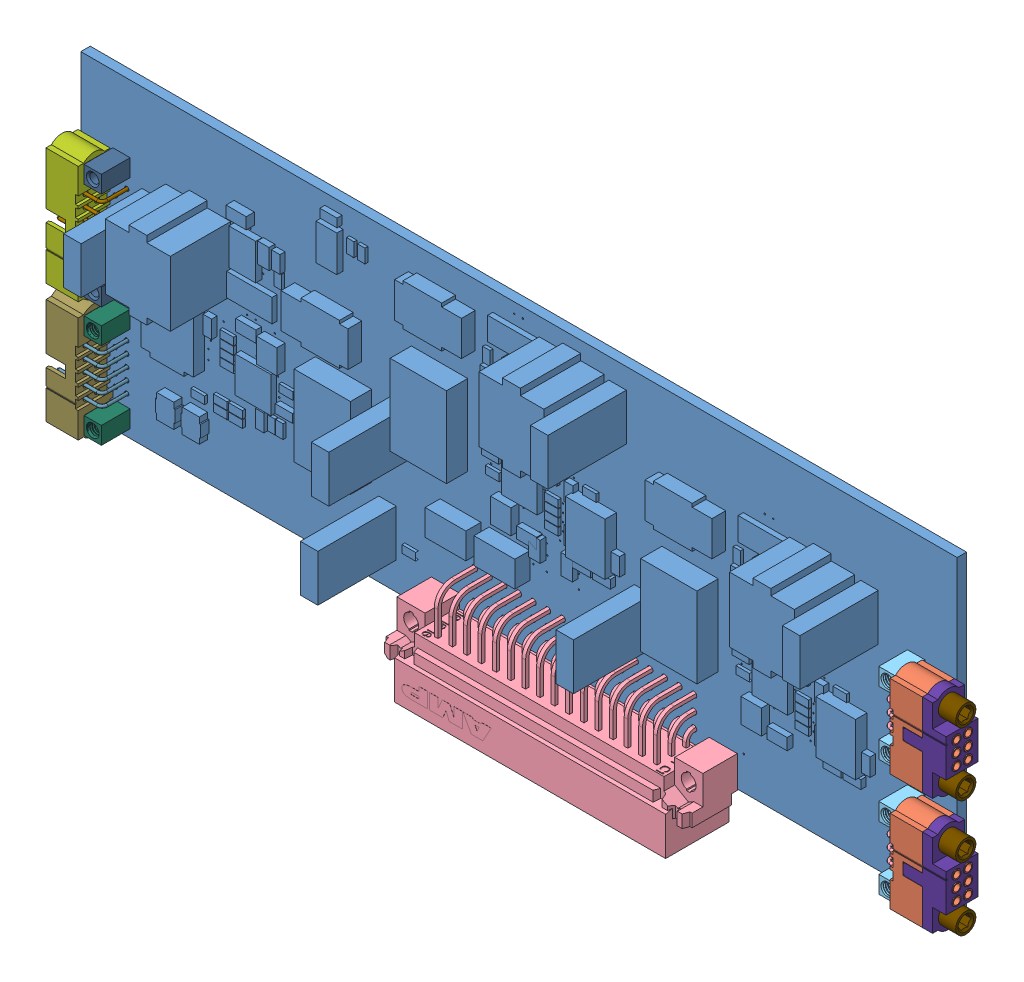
SolidWorks assembly SwitchBoard.SLDASM, configuration Default (file format 9000). Lengths in mm.
Overall size (157.18 61.26 17.98).
110 component instances, 22 part files, 20 mates.
Components (placement in the parent):
- 100221094ra_solid_4-1: 100221094ra_solid_4.SLDPRT [Default] at origin size (152.4 53.98 16.37)
- m80-5400642_asm-1: m80-5400642_asm.SLDASM [Default] at (148.998 28.797 4.9158) x (0 -1 0) z (0 0 1) size (16 9.1 9.13)
  - M80-2702098_SEPARATE_ROWS_1-1: M80-2702098_SEPARATE_ROWS_1.sldprt [Default] at origin size (16 5.6 6.05)
  - M80-530XX22_SHORT_PIN_1-1: M80-530XX22_SHORT_PIN_1.sldprt [Default] at (-2 -2.6 -1) x (0 -1 0) z (-1 0 0) size (5.95 5.68 0.8)
  - M80-530XX22_SHORT_PIN_1-2: M80-530XX22_SHORT_PIN_1.sldprt [Default] at (0 -2.6 -1) x (0 -1 0) z (-1 0 0) size (5.95 5.68 0.8)
  - M80-530XX22_SHORT_PIN_1-3: M80-530XX22_SHORT_PIN_1.sldprt [Default] at (2 -2.6 -1) x (0 -1 0) z (-1 0 0) size (5.95 5.68 0.8)
  - M80-530XX22_LONG_PIN_1-1: M80-530XX22_LONG_PIN_1.sldprt [Default] at (-2 -4.6 1) x (0 -1 0) z (-1 0 0) size (7.95 7.68 0.8)
  - M80-530XX22_LONG_PIN_1-2: M80-530XX22_LONG_PIN_1.sldprt [Default] at (0 -4.6 1) x (0 -1 0) z (-1 0 0) size (7.95 7.68 0.8)
  - M80-530XX22_LONG_PIN_1-3: M80-530XX22_LONG_PIN_1.sldprt [Default] at (2 -4.6 1) x (0 -1 0) z (-1 0 0) size (7.95 7.68 0.8)
  - M80-2250000-1: M80-2250000.sldprt [Default] at (5.5 -2.2 0) x (-1 0 0) z (0 1 0) size (3.1 5 7.5)
  - M80-2250000-2: M80-2250000.sldprt [Default] at (-5.5 -2.2 0) x (-1 0 0) z (0 1 0) size (3.1 5 7.5)
  - M80-226-1: M80-226.sldprt [Default] at (5.5 -3.7 -4.85) x (0 0 1) z (0 1 0) size (5 4 4)
  - M80-226-2: M80-226.sldprt [Default] at (-5.5 -3.7 -4.85) x (0 0 1) z (0 1 0) size (5 4 4)
- m80-5400642_asm-2: m80-5400642_asm.SLDASM [Default] at (148.998 8.477 4.9158) x (0 -1 0) z (0 0 1) size (16 9.1 9.13)
  - M80-2702098_SEPARATE_ROWS_1-1: M80-2702098_SEPARATE_ROWS_1.sldprt [Default] at origin size (16 5.6 6.05)
  - M80-530XX22_SHORT_PIN_1-1: M80-530XX22_SHORT_PIN_1.sldprt [Default] at (-2 -2.6 -1) x (0 -1 0) z (-1 0 0) size (5.95 5.68 0.8)
  - M80-530XX22_SHORT_PIN_1-2: M80-530XX22_SHORT_PIN_1.sldprt [Default] at (0 -2.6 -1) x (0 -1 0) z (-1 0 0) size (5.95 5.68 0.8)
  - M80-530XX22_SHORT_PIN_1-3: M80-530XX22_SHORT_PIN_1.sldprt [Default] at (2 -2.6 -1) x (0 -1 0) z (-1 0 0) size (5.95 5.68 0.8)
  - M80-530XX22_LONG_PIN_1-1: M80-530XX22_LONG_PIN_1.sldprt [Default] at (-2 -4.6 1) x (0 -1 0) z (-1 0 0) size (7.95 7.68 0.8)
  - M80-530XX22_LONG_PIN_1-2: M80-530XX22_LONG_PIN_1.sldprt [Default] at (0 -4.6 1) x (0 -1 0) z (-1 0 0) size (7.95 7.68 0.8)
  - M80-530XX22_LONG_PIN_1-3: M80-530XX22_LONG_PIN_1.sldprt [Default] at (2 -4.6 1) x (0 -1 0) z (-1 0 0) size (7.95 7.68 0.8)
  - M80-2250000-1: M80-2250000.sldprt [Default] at (5.5 -2.2 0) x (-1 0 0) z (0 1 0) size (3.1 5 7.5)
  - M80-2250000-2: M80-2250000.sldprt [Default] at (-5.5 -2.2 0) x (-1 0 0) z (0 1 0) size (3.1 5 7.5)
  - M80-226-1: M80-226.sldprt [Default] at (5.5 -3.7 -4.85) x (0 0 1) z (0 1 0) size (5 4 4)
  - M80-226-2: M80-226.sldprt [Default] at (-5.5 -3.7 -4.85) x (0 0 1) z (0 1 0) size (5 4 4)
- m80-54112xx_asm-1: m80-54112xx_asm.SLDASM [Default] at (3.402 32.305 4.9158) x (0 1 0) z (0 0 1) size (22 9.08 10.41)
  - M80-2700698_SEPARATE_ROWS-1: M80-2700698_SEPARATE_ROWS.sldprt [Default] at origin size (22 5.6 6.05)
  - M80-531XX22_SHORT_PIN-1: M80-531XX22_SHORT_PIN.sldprt [Default] at (-5 -2.6 -1) x (0 -1 0) z (-1 0 0) size (5.95 7.03 0.8)
  - M80-531XX22_SHORT_PIN-2: M80-531XX22_SHORT_PIN.sldprt [Default] at (-3 -2.6 -1) x (0 -1 0) z (-1 0 0) size (5.95 7.03 0.8)
  - M80-531XX22_SHORT_PIN-3: M80-531XX22_SHORT_PIN.sldprt [Default] at (-1 -2.6 -1) x (0 -1 0) z (-1 0 0) size (5.95 7.03 0.8)
  - M80-531XX22_SHORT_PIN-4: M80-531XX22_SHORT_PIN.sldprt [Default] at (1 -2.6 -1) x (0 -1 0) z (-1 0 0) size (5.95 7.03 0.8)
  - M80-531XX22_SHORT_PIN-5: M80-531XX22_SHORT_PIN.sldprt [Default] at (3 -2.6 -1) x (0 -1 0) z (-1 0 0) size (5.95 7.03 0.8)
  - M80-531XX22_SHORT_PIN-6: M80-531XX22_SHORT_PIN.sldprt [Default] at (5 -2.6 -1) x (0 -1 0) z (-1 0 0) size (5.95 7.03 0.8)
  - M80-531XX22_LONG_PIN-1: M80-531XX22_LONG_PIN.sldprt [Default] at (-5 -4.6 1) x (0 -1 0) z (-1 0 0) size (7.95 9.03 0.8)
  - M80-531XX22_LONG_PIN-2: M80-531XX22_LONG_PIN.sldprt [Default] at (-3 -4.6 1) x (0 -1 0) z (-1 0 0) size (7.95 9.03 0.8)
  - M80-531XX22_LONG_PIN-3: M80-531XX22_LONG_PIN.sldprt [Default] at (-1 -4.6 1) x (0 -1 0) z (-1 0 0) size (7.95 9.03 0.8)
  - M80-531XX22_LONG_PIN-4: M80-531XX22_LONG_PIN.sldprt [Default] at (1 -4.6 1) x (0 -1 0) z (-1 0 0) size (7.95 9.03 0.8)
  - M80-531XX22_LONG_PIN-5: M80-531XX22_LONG_PIN.sldprt [Default] at (3 -4.6 1) x (0 -1 0) z (-1 0 0) size (7.95 9.03 0.8)
  - M80-531XX22_LONG_PIN-6: M80-531XX22_LONG_PIN.sldprt [Default] at (5 -4.6 1) x (0 -1 0) z (-1 0 0) size (7.95 9.03 0.8)
  - M80-2250000_1-1: M80-2250000_1.sldprt [Default] at (8.5 -2.2 0) x (-1 0 0) z (0 1 0) size (3.1 5 7.5)
  - M80-2250000_1-2: M80-2250000_1.sldprt [Default] at (-8.5 -2.2 0) x (-1 0 0) z (0 1 0) size (3.1 5 7.5)
  - M80-227-1: M80-227.sldprt [Default] at (8.5 -3.7 -6.05) x (0 0 1) z (0 1 0) size (6.21 3.96 3.96)
  - M80-227-2: M80-227.sldprt [Default] at (-8.5 -3.7 -6.05) x (0 0 1) z (0 1 0) size (6.21 3.96 3.96)
- m80-5401042_asm-1: m80-5401042_asm.SLDASM [Default] at (3.402 10.477 4.9158) x (0 1 0) z (0 0 1) size (20 9.1 9.13)
  - M80-2702098_SEPARATE_ROWS_2-1: M80-2702098_SEPARATE_ROWS_2.sldprt [Default] at origin size (20 5.6 6.05)
  - M80-530XX22_SHORT_PIN_2-1: M80-530XX22_SHORT_PIN_2.sldprt [Default] at (-4 -2.6 -1) x (0 -1 0) z (-1 0 0) size (5.95 5.68 0.8)
  - M80-530XX22_SHORT_PIN_2-2: M80-530XX22_SHORT_PIN_2.sldprt [Default] at (-2 -2.6 -1) x (0 -1 0) z (-1 0 0) size (5.95 5.68 0.8)
  - M80-530XX22_SHORT_PIN_2-3: M80-530XX22_SHORT_PIN_2.sldprt [Default] at (0 -2.6 -1) x (0 -1 0) z (-1 0 0) size (5.95 5.68 0.8)
  - M80-530XX22_SHORT_PIN_2-4: M80-530XX22_SHORT_PIN_2.sldprt [Default] at (2 -2.6 -1) x (0 -1 0) z (-1 0 0) size (5.95 5.68 0.8)
  - M80-530XX22_SHORT_PIN_2-5: M80-530XX22_SHORT_PIN_2.sldprt [Default] at (4 -2.6 -1) x (0 -1 0) z (-1 0 0) size (5.95 5.68 0.8)
  - M80-530XX22_LONG_PIN_2-1: M80-530XX22_LONG_PIN_2.sldprt [Default] at (-4 -4.6 1) x (0 -1 0) z (-1 0 0) size (7.95 7.68 0.8)
  - M80-530XX22_LONG_PIN_2-2: M80-530XX22_LONG_PIN_2.sldprt [Default] at (-2 -4.6 1) x (0 -1 0) z (-1 0 0) size (7.95 7.68 0.8)
  - M80-530XX22_LONG_PIN_2-3: M80-530XX22_LONG_PIN_2.sldprt [Default] at (0 -4.6 1) x (0 -1 0) z (-1 0 0) size (7.95 7.68 0.8)
  - M80-530XX22_LONG_PIN_2-4: M80-530XX22_LONG_PIN_2.sldprt [Default] at (2 -4.6 1) x (0 -1 0) z (-1 0 0) size (7.95 7.68 0.8)
  - M80-530XX22_LONG_PIN_2-5: M80-530XX22_LONG_PIN_2.sldprt [Default] at (4 -4.6 1) x (0 -1 0) z (-1 0 0) size (7.95 7.68 0.8)
  - M80-2250000_2-1: M80-2250000_2.sldprt [Default] at (7.5 -2.2 0) x (-1 0 0) z (0 1 0) size (3.1 5 7.5)
  - M80-2250000_2-2: M80-2250000_2.sldprt [Default] at (-7.5 -2.2 0) x (-1 0 0) z (0 1 0) size (3.1 5 7.5)
  - M80-226_1-1: M80-226_1.sldprt [Default] at (7.5 -3.7 -4.85) x (0 0 1) z (0 1 0) size (5 4 4)
  - M80-226_1-2: M80-226_1.sldprt [Default] at (-7.5 -3.7 -4.85) x (0 0 1) z (0 1 0) size (5 4 4)
- m80-4810642_asm-1: m80-4810642_asm.SLDASM [Default] at (148.978 8.477 4.9158) x (0 1 0) z (0 0 1) size (16 8.5 5.55)
  - M80-2662098_ASM_1-1: M80-2662098_ASM_1.sldasm [Default] at origin size (16 8.5 5.55)
    - M80-2625098_1-1: M80-2625098_1.sldprt [Default] at origin size (16 7.55 5.55)
    - M80-218_1-1: M80-218_1.sldprt [Default] at (5.5 -5.2 0) x (0.866025 0 -0.5) z (-0.5 0 -0.866025) size (3.5 8.5 3.5)
    - M80-218_1-2: M80-218_1.sldprt [Default] at (-5.5 -5.2 0) x (0.866025 0 0.5) z (0.5 0 -0.866025) size (3.5 8.5 3.5)
    - M80-215_1-1: M80-215_1.sldprt [Default] at (5.5 -3.12 0) size (3 0.3 2.57)
    - M80-215_1-2: M80-215_1.sldprt [Default] at (-5.5 -3.12 0) size (3 0.3 2.57)
  - M80-013_ASM_1-1: M80-013_ASM_1.sldasm [Default] at (-2 -7.65 -1) x (-1 0 0) z (0 0 1) size (1.48 7.45 1.48)
    - M80-012_1-1: M80-012_1.sldprt [Default] at origin size (1.48 7.45 1.48)
    - Y3198_1-1: Y3198_1.sldprt [Default] at (0 -6.44 0) x (-1 0 0) z (0 0 1) size (0.86 1.68 0.86)
  - M80-013_ASM_1-2: M80-013_ASM_1.sldasm [Default] at (0 -7.65 -1) x (-1 0 0) z (0 0 1) size (1.48 7.45 1.48)
    - M80-012_1-1: M80-012_1.sldprt [Default] at origin size (1.48 7.45 1.48)
    - Y3198_1-1: Y3198_1.sldprt [Default] at (0 -6.44 0) x (-1 0 0) z (0 0 1) size (0.86 1.68 0.86)
  - M80-013_ASM_1-3: M80-013_ASM_1.sldasm [Default] at (2 -7.65 -1) x (-1 0 0) z (0 0 1) size (1.48 7.45 1.48)
    - M80-012_1-1: M80-012_1.sldprt [Default] at origin size (1.48 7.45 1.48)
    - Y3198_1-1: Y3198_1.sldprt [Default] at (0 -6.44 0) x (-1 0 0) z (0 0 1) size (0.86 1.68 0.86)
  - M80-013_ASM_1-4: M80-013_ASM_1.sldasm [Default] at (-2 -7.65 1) x (-1 0 0) z (0 0 1) size (1.48 7.45 1.48)
    - M80-012_1-1: M80-012_1.sldprt [Default] at origin size (1.48 7.45 1.48)
    - Y3198_1-1: Y3198_1.sldprt [Default] at (0 -6.44 0) x (-1 0 0) z (0 0 1) size (0.86 1.68 0.86)
  - M80-013_ASM_1-5: M80-013_ASM_1.sldasm [Default] at (0 -7.65 1) x (-1 0 0) z (0 0 1) size (1.48 7.45 1.48)
    - M80-012_1-1: M80-012_1.sldprt [Default] at origin size (1.48 7.45 1.48)
    - Y3198_1-1: Y3198_1.sldprt [Default] at (0 -6.44 0) x (-1 0 0) z (0 0 1) size (0.86 1.68 0.86)
  - M80-013_ASM_1-6: M80-013_ASM_1.sldasm [Default] at (2 -7.65 1) x (-1 0 0) z (0 0 1) size (1.48 7.45 1.48)
    - M80-012_1-1: M80-012_1.sldprt [Default] at origin size (1.48 7.45 1.48)
    - Y3198_1-1: Y3198_1.sldprt [Default] at (0 -6.44 0) x (-1 0 0) z (0 0 1) size (0.86 1.68 0.86)
- m80-4810642_asm-2: m80-4810642_asm.SLDASM [Default] at (148.978 28.797 4.9158) x (0 1 0) z (0 0 1) size (16 8.5 5.55)
  - M80-2662098_ASM_1-1: M80-2662098_ASM_1.sldasm [Default] at origin size (16 8.5 5.55)
    - M80-2625098_1-1: M80-2625098_1.sldprt [Default] at origin size (16 7.55 5.55)
    - M80-218_1-1: M80-218_1.sldprt [Default] at (5.5 -5.2 0) x (0.866025 0 -0.5) z (-0.5 0 -0.866025) size (3.5 8.5 3.5)
    - M80-218_1-2: M80-218_1.sldprt [Default] at (-5.5 -5.2 0) x (0.866025 0 0.5) z (0.5 0 -0.866025) size (3.5 8.5 3.5)
    - M80-215_1-1: M80-215_1.sldprt [Default] at (5.5 -3.12 0) size (3 0.3 2.57)
    - M80-215_1-2: M80-215_1.sldprt [Default] at (-5.5 -3.12 0) size (3 0.3 2.57)
  - M80-013_ASM_1-1: M80-013_ASM_1.sldasm [Default] at (-2 -7.65 -1) x (-1 0 0) z (0 0 1) size (1.48 7.45 1.48)
    - M80-012_1-1: M80-012_1.sldprt [Default] at origin size (1.48 7.45 1.48)
    - Y3198_1-1: Y3198_1.sldprt [Default] at (0 -6.44 0) x (-1 0 0) z (0 0 1) size (0.86 1.68 0.86)
  - M80-013_ASM_1-2: M80-013_ASM_1.sldasm [Default] at (0 -7.65 -1) x (-1 0 0) z (0 0 1) size (1.48 7.45 1.48)
    - M80-012_1-1: M80-012_1.sldprt [Default] at origin size (1.48 7.45 1.48)
    - Y3198_1-1: Y3198_1.sldprt [Default] at (0 -6.44 0) x (-1 0 0) z (0 0 1) size (0.86 1.68 0.86)
  - M80-013_ASM_1-3: M80-013_ASM_1.sldasm [Default] at (2 -7.65 -1) x (-1 0 0) z (0 0 1) size (1.48 7.45 1.48)
    - M80-012_1-1: M80-012_1.sldprt [Default] at origin size (1.48 7.45 1.48)
    - Y3198_1-1: Y3198_1.sldprt [Default] at (0 -6.44 0) x (-1 0 0) z (0 0 1) size (0.86 1.68 0.86)
  - M80-013_ASM_1-4: M80-013_ASM_1.sldasm [Default] at (-2 -7.65 1) x (-1 0 0) z (0 0 1) size (1.48 7.45 1.48)
    - M80-012_1-1: M80-012_1.sldprt [Default] at origin size (1.48 7.45 1.48)
    - Y3198_1-1: Y3198_1.sldprt [Default] at (0 -6.44 0) x (-1 0 0) z (0 0 1) size (0.86 1.68 0.86)
  - M80-013_ASM_1-5: M80-013_ASM_1.sldasm [Default] at (0 -7.65 1) x (-1 0 0) z (0 0 1) size (1.48 7.45 1.48)
    - M80-012_1-1: M80-012_1.sldprt [Default] at origin size (1.48 7.45 1.48)
    - Y3198_1-1: Y3198_1.sldprt [Default] at (0 -6.44 0) x (-1 0 0) z (0 0 1) size (0.86 1.68 0.86)
  - M80-013_ASM_1-6: M80-013_ASM_1.sldasm [Default] at (2 -7.65 1) x (-1 0 0) z (0 0 1) size (1.48 7.45 1.48)
    - M80-012_1-1: M80-012_1.sldprt [Default] at origin size (1.48 7.45 1.48)
    - Y3198_1-1: Y3198_1.sldprt [Default] at (0 -6.44 0) x (-1 0 0) z (0 0 1) size (0.86 1.68 0.86)
- c-650948-5-m-3d-1: c-650948-5-m-3d.SLDPRT [Default] at (87.5792 -7.2804 5.5758) x (1 0 0) z (0 -1 0) size (53.21 12.76 18.02)
Mates (geometry in assembly coordinates):
- Concentric1: concentric aligned: cylinder of 100221094ra_solid_4-1 through (146.398 6.477 1.6408) axis (0 0 -1) radius 0.3556; cylinder of m80-5400642_asm-2/M80-530XX22_SHORT_PIN_1-3 through (146.398 6.477 3.1658) axis (0 0 -1) radius 0.248
- Coincident1: coincident anti-aligned: plane of 100221094ra_solid_4-1 through (0 0 1.6408) normal (0 0 1); plane of m80-5400642_asm-2/M80-2702098_SEPARATE_ROWS_1-1 through (152.398 12.227 1.6408) normal (0 0 -1)
- Parallel3: parallel aligned: plane of 100221094ra_solid_4-1 through (152.4 0 1.6408) normal (1 0 0); plane of m80-5400642_asm-2/M80-2702098_SEPARATE_ROWS_1-1 through (152.398 8.477 4.9158) normal (1 0 0)
- Coincident2: coincident anti-aligned: plane of 100221094ra_solid_4-1 through (0 0 1.6408) normal (0 0 1); plane of m80-5400642_asm-1/M80-2702098_SEPARATE_ROWS_1-1 through (152.398 25.047 1.6408) normal (0 0 -1)
- Concentric6: concentric aligned: cylinder of 100221094ra_solid_4-1 through (146.398 26.797 1.6408) axis (0 0 -1) radius 0.3556; cylinder of m80-5400642_asm-1/M80-530XX22_SHORT_PIN_1-3 through (146.398 26.797 3.1658) axis (0 0 -1) radius 0.248
- Parallel4: parallel aligned: plane of 100221094ra_solid_4-1 through (152.4 0 1.6408) normal (1 0 0); plane of m80-5400642_asm-1/M80-2702098_SEPARATE_ROWS_1-1 through (152.398 28.797 4.9158) normal (1 0 0)
- Concentric7: concentric aligned: cylinder of 100221094ra_solid_4-1 through (6.002 27.305 1.6408) axis (0 0 -1) radius 0.3683; cylinder of m80-54112xx_asm-1/M80-531XX22_SHORT_PIN-1 through (6.002 27.305 3.1658) axis (0 0 -1) radius 0.246
- Coincident4: coincident anti-aligned: plane of 100221094ra_solid_4-1 through (0 0 1.6408) normal (0 0 1); plane of m80-54112xx_asm-1/M80-2700698_SEPARATE_ROWS-1 through (0.002 25.555 1.6408) normal (0 0 -1)
- Parallel5: parallel aligned: plane of 100221094ra_solid_4-1 through (0 53.975 1.6408) normal (-1 0 0); plane of m80-54112xx_asm-1/M80-2700698_SEPARATE_ROWS-1 through (0.002 32.305 4.9158) normal (-1 0 0)
- Coincident6: coincident anti-aligned: plane of 100221094ra_solid_4-1 through (0 0 1.6408) normal (0 0 1); plane of m80-5401042_asm-1/M80-2702098_SEPARATE_ROWS_2-1 through (0.002 4.727 1.6408) normal (0 0 -1)
- Concentric8: concentric aligned: cylinder of 100221094ra_solid_4-1 through (6.002 6.477 1.6408) axis (0 0 -1) radius 0.3683; cylinder of m80-5401042_asm-1/M80-530XX22_SHORT_PIN_2-1 through (6.002 6.477 3.1658) axis (0 0 -1) radius 0.248
- Parallel6: parallel aligned: plane of 100221094ra_solid_4-1 through (0 53.975 1.6408) normal (-1 0 0); plane of m80-5401042_asm-1/M80-2702098_SEPARATE_ROWS_2-1 through (0.002 10.477 4.9158) normal (-1 0 0)
- Concentric9: concentric anti-aligned: circle of m80-5400642_asm-2/M80-2702098_SEPARATE_ROWS_1-1; cylinder of m80-4810642_asm-1/M80-2662098_ASM_1-1/M80-218_1-1 through (154.178 13.977 4.9158) axis (1 0 0) radius 1.75
- Coincident8: coincident anti-aligned: plane of m80-5400642_asm-2/M80-2702098_SEPARATE_ROWS_1-1 through (152.398 8.477 4.9158) normal (1 0 0); plane of m80-4810642_asm-1/M80-2662098_ASM_1-1/M80-2625098_1-1 through (152.398 8.477 4.9158) normal (-1 0 0)
- Concentric10: concentric anti-aligned: cylinder of m80-5400642_asm-2/M80-2702098_SEPARATE_ROWS_1-1 through (152.398 2.977 4.9158) axis (-1 0 0) radius 1.6; cylinder of m80-4810642_asm-1/M80-2662098_ASM_1-1/M80-218_1-2 through (154.178 2.977 4.9158) axis (1 0 0) radius 1.75
- Concentric11: concentric anti-aligned: cylinder of m80-5400642_asm-1/M80-2702098_SEPARATE_ROWS_1-1 through (152.398 23.297 4.9158) axis (-1 0 0) radius 1.6; cylinder of m80-4810642_asm-2/M80-2662098_ASM_1-1/M80-218_1-2 through (154.178 23.297 4.9158) axis (1 0 0) radius 1.75
- Concentric12: concentric aligned: cylinder of m80-5400642_asm-1/M80-2702098_SEPARATE_ROWS_1-1 through (152.398 34.297 4.9158) axis (1 0 0) radius 1.6; cylinder of m80-4810642_asm-2/M80-2662098_ASM_1-1/M80-218_1-1 through (154.178 34.297 4.9158) axis (1 0 0) radius 1.75
- Coincident9: coincident anti-aligned: plane of m80-5400642_asm-1/M80-2702098_SEPARATE_ROWS_1-1 through (152.398 28.797 4.9158) normal (1 0 0); plane of m80-4810642_asm-2/M80-2662098_ASM_1-1/M80-2625098_1-1 through (152.398 28.797 4.9158) normal (-1 0 0)
- Concentric13: concentric anti-aligned: cylinder of 100221094ra_solid_4-1 through (111.7092 2.8296 1.6408) axis (0 0 -1) radius 1.397; cylinder of c-650948-5-m-3d-1 through (111.7092 2.8296 7.6408) axis (0 0 1) radius 1.295
- Coincident11: coincident anti-aligned: plane of 100221094ra_solid_4-1 through (0 0 1.6408) normal (0 0 1); plane of c-650948-5-m-3d-1 through (64.0192 -0.1904 1.6408) normal (0 0 -1)
